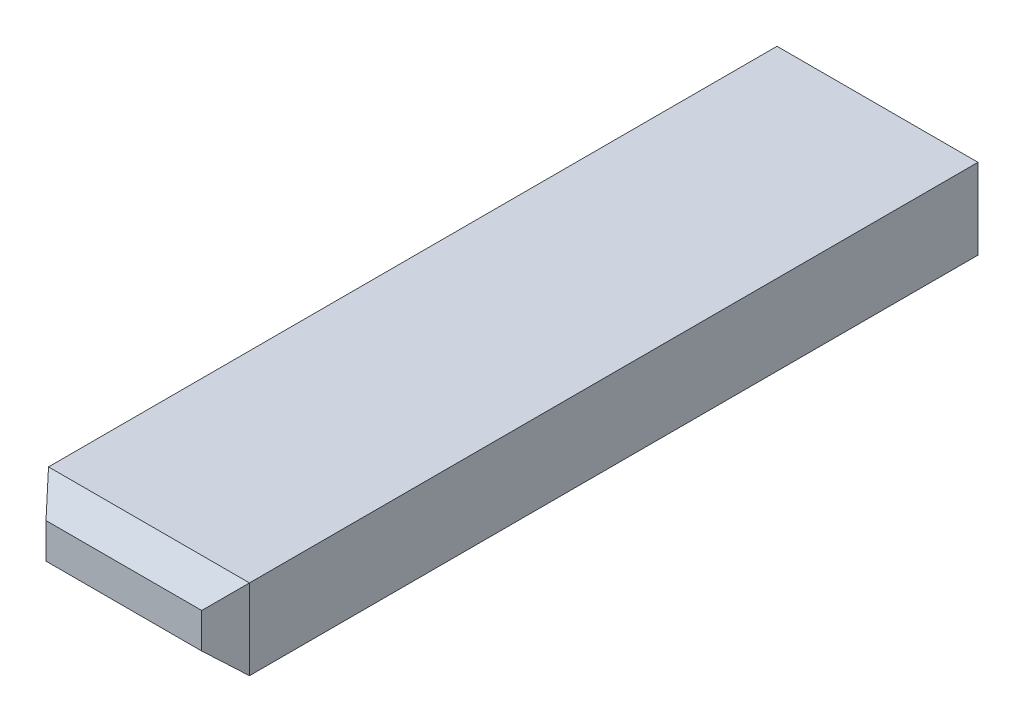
ISO-10303-21;
HEADER;
FILE_DESCRIPTION(('STEP AP214'),'2;1');
FILE_NAME('part.step','',(''),(''),'','','');
FILE_SCHEMA(('AUTOMOTIVE_DESIGN { 1 0 10303 214 1 1 1 1 }'));
ENDSEC;
DATA;
#1=APPLICATION_CONTEXT('core data for automotive mechanical design processes');
#2=APPLICATION_PROTOCOL_DEFINITION('international standard','automotive_design',2000,#1);
#3=PRODUCT_CONTEXT('',#1,'mechanical');
#4=PRODUCT('Part','Part','',(#3));
#5=PRODUCT_RELATED_PRODUCT_CATEGORY('part','',(#4));
#6=PRODUCT_DEFINITION_FORMATION('','',#4);
#7=PRODUCT_DEFINITION_CONTEXT('part definition',#1,'design');
#8=PRODUCT_DEFINITION('design','',#6,#7);
#9=PRODUCT_DEFINITION_SHAPE('','',#8);
#10=(LENGTH_UNIT() NAMED_UNIT(*) SI_UNIT(.MILLI.,.METRE.));
#11=(NAMED_UNIT(*) PLANE_ANGLE_UNIT() SI_UNIT($,.RADIAN.));
#12=(NAMED_UNIT(*) SI_UNIT($,.STERADIAN.) SOLID_ANGLE_UNIT());
#13=UNCERTAINTY_MEASURE_WITH_UNIT(LENGTH_MEASURE(1.E-05),#10,'distance_accuracy_value','');
#14=(GEOMETRIC_REPRESENTATION_CONTEXT(3) GLOBAL_UNCERTAINTY_ASSIGNED_CONTEXT((#13)) GLOBAL_UNIT_ASSIGNED_CONTEXT((#10,
#11,#12)) REPRESENTATION_CONTEXT('',''));
#15=CARTESIAN_POINT('',(0.,0.,0.));
#16=DIRECTION('',(0.,0.,1.));
#17=DIRECTION('',(1.,0.,0.));
#18=AXIS2_PLACEMENT_3D('',#15,#16,#17);
#19=CARTESIAN_POINT('',(0.,0.,15.));
#20=DIRECTION('',(1.,0.,0.));
#21=DIRECTION('',(0.,0.,-1.));
#22=AXIS2_PLACEMENT_3D('',#19,#20,#21);
#23=PLANE('',#22);
#24=DIRECTION('',(0.,0.,-1.));
#25=VECTOR('',#24,1.);
#26=CARTESIAN_POINT('',(0.,0.,15.));
#27=LINE('',#26,#25);
#28=CARTESIAN_POINT('',(0.,0.,14.5));
#29=VERTEX_POINT('',#28);
#30=CARTESIAN_POINT('',(0.,0.,0.));
#31=VERTEX_POINT('',#30);
#32=EDGE_CURVE('E81',#29,#31,#27,.T.);
#33=ORIENTED_EDGE('',*,*,#32,.F.);
#34=DIRECTION('',(0.,1.,0.));
#35=VECTOR('',#34,1.);
#36=CARTESIAN_POINT('',(0.,0.,14.5));
#37=LINE('',#36,#35);
#38=CARTESIAN_POINT('',(0.,1.6,14.5));
#39=VERTEX_POINT('',#38);
#40=EDGE_CURVE('E11',#29,#39,#37,.T.);
#41=ORIENTED_EDGE('',*,*,#40,.T.);
#42=DIRECTION('',(0.,0.,-1.));
#43=VECTOR('',#42,1.);
#44=CARTESIAN_POINT('',(0.,1.6,15.));
#45=LINE('',#44,#43);
#46=CARTESIAN_POINT('',(0.,1.6,0.));
#47=VERTEX_POINT('',#46);
#48=EDGE_CURVE('E101',#39,#47,#45,.T.);
#49=ORIENTED_EDGE('',*,*,#48,.T.);
#50=DIRECTION('',(0.,-1.,0.));
#51=VECTOR('',#50,1.);
#52=CARTESIAN_POINT('',(0.,0.,0.));
#53=LINE('',#52,#51);
#54=EDGE_CURVE('E96',#47,#31,#53,.T.);
#55=ORIENTED_EDGE('',*,*,#54,.T.);
#56=EDGE_LOOP('',(#33,#41,#49,#55));
#57=FACE_BOUND('',#56,.T.);
#58=ADVANCED_FACE('F32',(#57),#23,.F.);
#59=CARTESIAN_POINT('',(0.,0.,15.));
#60=DIRECTION('',(0.,1.,0.));
#61=DIRECTION('',(0.,0.,1.));
#62=AXIS2_PLACEMENT_3D('',#59,#60,#61);
#63=PLANE('',#62);
#64=DIRECTION('',(0.,0.,-1.));
#65=VECTOR('',#64,1.);
#66=CARTESIAN_POINT('',(4.,0.,15.));
#67=LINE('',#66,#65);
#68=CARTESIAN_POINT('',(4.,0.,14.5));
#69=VERTEX_POINT('',#68);
#70=CARTESIAN_POINT('',(4.,0.,0.));
#71=VERTEX_POINT('',#70);
#72=EDGE_CURVE('E90',#69,#71,#67,.T.);
#73=ORIENTED_EDGE('',*,*,#72,.F.);
#74=DIRECTION('',(-1.,0.,0.));
#75=VECTOR('',#74,1.);
#76=CARTESIAN_POINT('',(0.,0.,14.5));
#77=LINE('',#76,#75);
#78=EDGE_CURVE('E39',#69,#29,#77,.T.);
#79=ORIENTED_EDGE('',*,*,#78,.T.);
#80=ORIENTED_EDGE('',*,*,#32,.T.);
#81=DIRECTION('',(1.,0.,0.));
#82=VECTOR('',#81,1.);
#83=CARTESIAN_POINT('',(0.,0.,0.));
#84=LINE('',#83,#82);
#85=EDGE_CURVE('E84',#31,#71,#84,.T.);
#86=ORIENTED_EDGE('',*,*,#85,.T.);
#87=EDGE_LOOP('',(#73,#79,#80,#86));
#88=FACE_BOUND('',#87,.T.);
#89=ADVANCED_FACE('F83',(#88),#63,.F.);
#90=CARTESIAN_POINT('',(4.,0.,15.));
#91=DIRECTION('',(-1.,0.,0.));
#92=DIRECTION('',(0.,0.,1.));
#93=AXIS2_PLACEMENT_3D('',#90,#91,#92);
#94=PLANE('',#93);
#95=DIRECTION('',(0.,0.,-1.));
#96=VECTOR('',#95,1.);
#97=CARTESIAN_POINT('',(4.,1.6,15.));
#98=LINE('',#97,#96);
#99=CARTESIAN_POINT('',(4.,1.6,14.5));
#100=VERTEX_POINT('',#99);
#101=CARTESIAN_POINT('',(4.,1.6,0.));
#102=VERTEX_POINT('',#101);
#103=EDGE_CURVE('E114',#100,#102,#98,.T.);
#104=ORIENTED_EDGE('',*,*,#103,.F.);
#105=DIRECTION('',(0.,-1.,0.));
#106=VECTOR('',#105,1.);
#107=CARTESIAN_POINT('',(4.,0.,14.5));
#108=LINE('',#107,#106);
#109=EDGE_CURVE('E53',#100,#69,#108,.T.);
#110=ORIENTED_EDGE('',*,*,#109,.T.);
#111=ORIENTED_EDGE('',*,*,#72,.T.);
#112=DIRECTION('',(0.,1.,0.));
#113=VECTOR('',#112,1.);
#114=CARTESIAN_POINT('',(4.,0.,0.));
#115=LINE('',#114,#113);
#116=EDGE_CURVE('E98',#71,#102,#115,.T.);
#117=ORIENTED_EDGE('',*,*,#116,.T.);
#118=EDGE_LOOP('',(#104,#110,#111,#117));
#119=FACE_BOUND('',#118,.T.);
#120=ADVANCED_FACE('F133',(#119),#94,.F.);
#121=CARTESIAN_POINT('',(0.,1.6,15.));
#122=DIRECTION('',(0.,-1.,0.));
#123=DIRECTION('',(1.,0.,0.));
#124=AXIS2_PLACEMENT_3D('',#121,#122,#123);
#125=PLANE('',#124);
#126=ORIENTED_EDGE('',*,*,#48,.F.);
#127=DIRECTION('',(1.,0.,0.));
#128=VECTOR('',#127,1.);
#129=CARTESIAN_POINT('',(0.,1.6,14.5));
#130=LINE('',#129,#128);
#131=EDGE_CURVE('E125',#39,#100,#130,.T.);
#132=ORIENTED_EDGE('',*,*,#131,.T.);
#133=ORIENTED_EDGE('',*,*,#103,.T.);
#134=DIRECTION('',(-1.,0.,0.));
#135=VECTOR('',#134,1.);
#136=CARTESIAN_POINT('',(0.,1.6,0.));
#137=LINE('',#136,#135);
#138=EDGE_CURVE('E111',#102,#47,#137,.T.);
#139=ORIENTED_EDGE('',*,*,#138,.T.);
#140=EDGE_LOOP('',(#126,#132,#133,#139));
#141=FACE_BOUND('',#140,.T.);
#142=ADVANCED_FACE('F130',(#141),#125,.F.);
#143=CARTESIAN_POINT('',(0.,0.,15.));
#144=DIRECTION('',(0.,0.,-1.));
#145=DIRECTION('',(-1.,0.,0.));
#146=AXIS2_PLACEMENT_3D('',#143,#144,#145);
#147=PLANE('',#146);
#148=DIRECTION('',(0.,1.,0.));
#149=VECTOR('',#148,1.);
#150=CARTESIAN_POINT('',(3.54979797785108,0.,15.));
#151=LINE('',#150,#149);
#152=CARTESIAN_POINT('',(3.54979797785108,0.45020202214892,15.));
#153=VERTEX_POINT('',#152);
#154=CARTESIAN_POINT('',(3.54979797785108,1.14979797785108,15.));
#155=VERTEX_POINT('',#154);
#156=EDGE_CURVE('E120',#153,#155,#151,.T.);
#157=ORIENTED_EDGE('',*,*,#156,.T.);
#158=DIRECTION('',(-1.,0.,0.));
#159=VECTOR('',#158,1.);
#160=CARTESIAN_POINT('',(0.,1.14979797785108,15.));
#161=LINE('',#160,#159);
#162=CARTESIAN_POINT('',(0.45020202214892,1.14979797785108,15.));
#163=VERTEX_POINT('',#162);
#164=EDGE_CURVE('E122',#155,#163,#161,.T.);
#165=ORIENTED_EDGE('',*,*,#164,.T.);
#166=DIRECTION('',(0.,-1.,0.));
#167=VECTOR('',#166,1.);
#168=CARTESIAN_POINT('',(0.45020202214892,0.,15.));
#169=LINE('',#168,#167);
#170=CARTESIAN_POINT('',(0.45020202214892,0.45020202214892,15.));
#171=VERTEX_POINT('',#170);
#172=EDGE_CURVE('E89',#163,#171,#169,.T.);
#173=ORIENTED_EDGE('',*,*,#172,.T.);
#174=DIRECTION('',(1.,0.,0.));
#175=VECTOR('',#174,1.);
#176=CARTESIAN_POINT('',(0.,0.45020202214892,15.));
#177=LINE('',#176,#175);
#178=EDGE_CURVE('E118',#171,#153,#177,.T.);
#179=ORIENTED_EDGE('',*,*,#178,.T.);
#180=EDGE_LOOP('',(#157,#165,#173,#179));
#181=FACE_BOUND('',#180,.T.);
#182=ADVANCED_FACE('F147',(#181),#147,.F.);
#183=CARTESIAN_POINT('',(0.,0.,0.));
#184=DIRECTION('',(0.,0.,-1.));
#185=DIRECTION('',(-1.,0.,0.));
#186=AXIS2_PLACEMENT_3D('',#183,#184,#185);
#187=PLANE('',#186);
#188=ORIENTED_EDGE('',*,*,#54,.F.);
#189=ORIENTED_EDGE('',*,*,#138,.F.);
#190=ORIENTED_EDGE('',*,*,#116,.F.);
#191=ORIENTED_EDGE('',*,*,#85,.F.);
#192=EDGE_LOOP('',(#188,#189,#190,#191));
#193=FACE_BOUND('',#192,.T.);
#194=ADVANCED_FACE('F94',(#193),#187,.T.);
#195=CARTESIAN_POINT('',(0.,0.45020202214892,15.));
#196=DIRECTION('',(0.,0.743144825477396,-0.669130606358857));
#197=DIRECTION('',(0.,0.669130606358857,0.743144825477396));
#198=AXIS2_PLACEMENT_3D('',#195,#196,#197);
#199=PLANE('',#198);
#200=DIRECTION('',(0.556117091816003,0.556117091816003,0.617630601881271));
#201=VECTOR('',#200,1.);
#202=CARTESIAN_POINT('',(0.310969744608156,0.310969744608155,14.8453668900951));
#203=LINE('',#202,#201);
#204=EDGE_CURVE('E106',#29,#171,#203,.T.);
#205=ORIENTED_EDGE('',*,*,#204,.F.);
#206=ORIENTED_EDGE('',*,*,#78,.F.);
#207=DIRECTION('',(-0.556117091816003,0.556117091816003,0.617630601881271));
#208=VECTOR('',#207,1.);
#209=CARTESIAN_POINT('',(2.45196537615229,1.54803462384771,16.2192666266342));
#210=LINE('',#209,#208);
#211=EDGE_CURVE('E103',#153,#69,#210,.F.);
#212=ORIENTED_EDGE('',*,*,#211,.F.);
#213=ORIENTED_EDGE('',*,*,#178,.F.);
#214=EDGE_LOOP('',(#205,#206,#212,#213));
#215=FACE_BOUND('',#214,.T.);
#216=ADVANCED_FACE('F136',(#215),#199,.F.);
#217=CARTESIAN_POINT('',(3.54979797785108,0.,15.));
#218=DIRECTION('',(-0.743144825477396,0.,-0.669130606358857));
#219=DIRECTION('',(-0.669130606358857,0.,0.743144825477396));
#220=AXIS2_PLACEMENT_3D('',#217,#218,#219);
#221=PLANE('',#220);
#222=ORIENTED_EDGE('',*,*,#211,.T.);
#223=ORIENTED_EDGE('',*,*,#109,.F.);
#224=DIRECTION('',(-0.556117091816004,-0.556117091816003,0.617630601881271));
#225=VECTOR('',#224,1.);
#226=CARTESIAN_POINT('',(3.19420430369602,0.794204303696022,15.3949267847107));
#227=LINE('',#226,#225);
#228=EDGE_CURVE('E144',#155,#100,#227,.F.);
#229=ORIENTED_EDGE('',*,*,#228,.F.);
#230=ORIENTED_EDGE('',*,*,#156,.F.);
#231=EDGE_LOOP('',(#222,#223,#229,#230));
#232=FACE_BOUND('',#231,.T.);
#233=ADVANCED_FACE('F142',(#232),#221,.F.);
#234=CARTESIAN_POINT('',(0.45020202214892,0.,15.));
#235=DIRECTION('',(0.743144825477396,0.,-0.669130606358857));
#236=DIRECTION('',(-0.669130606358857,0.,-0.743144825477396));
#237=AXIS2_PLACEMENT_3D('',#234,#235,#236);
#238=PLANE('',#237);
#239=ORIENTED_EDGE('',*,*,#204,.T.);
#240=ORIENTED_EDGE('',*,*,#172,.F.);
#241=DIRECTION('',(-0.556117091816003,0.556117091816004,-0.617630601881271));
#242=VECTOR('',#241,1.);
#243=CARTESIAN_POINT('',(0.805795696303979,0.794204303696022,15.3949267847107));
#244=LINE('',#243,#242);
#245=EDGE_CURVE('E151',#39,#163,#244,.F.);
#246=ORIENTED_EDGE('',*,*,#245,.F.);
#247=ORIENTED_EDGE('',*,*,#40,.F.);
#248=EDGE_LOOP('',(#239,#240,#246,#247));
#249=FACE_BOUND('',#248,.T.);
#250=ADVANCED_FACE('F150',(#249),#238,.F.);
#251=CARTESIAN_POINT('',(0.,1.14979797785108,15.));
#252=DIRECTION('',(0.,-0.743144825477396,-0.669130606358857));
#253=DIRECTION('',(0.,0.669130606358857,-0.743144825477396));
#254=AXIS2_PLACEMENT_3D('',#251,#252,#253);
#255=PLANE('',#254);
#256=ORIENTED_EDGE('',*,*,#228,.T.);
#257=ORIENTED_EDGE('',*,*,#131,.F.);
#258=ORIENTED_EDGE('',*,*,#245,.T.);
#259=ORIENTED_EDGE('',*,*,#164,.F.);
#260=EDGE_LOOP('',(#256,#257,#258,#259));
#261=FACE_BOUND('',#260,.T.);
#262=ADVANCED_FACE('F154',(#261),#255,.F.);
#263=CLOSED_SHELL('',(#58,#89,#120,#142,#182,#194,#216,#233,#250,#262));
#264=MANIFOLD_SOLID_BREP('B2',#263);
#265=ADVANCED_BREP_SHAPE_REPRESENTATION('',(#18,#264),#14);
#266=SHAPE_DEFINITION_REPRESENTATION(#9,#265);
ENDSEC;
END-ISO-10303-21;
